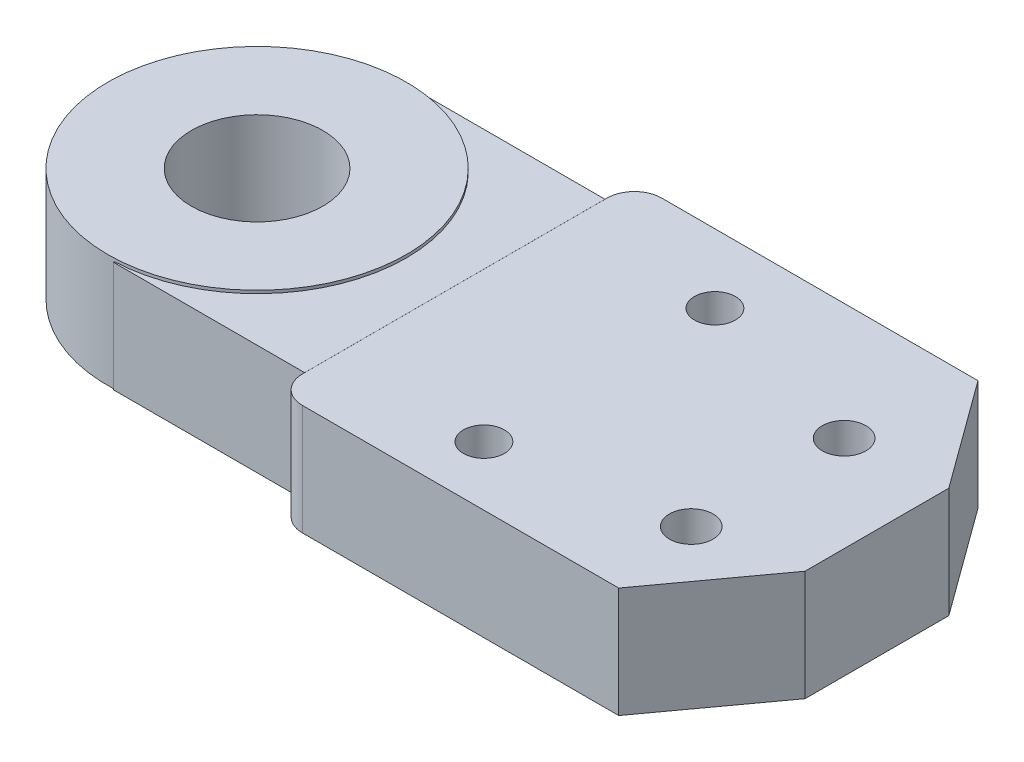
ISO-10303-21;
HEADER;
FILE_DESCRIPTION(('STEP AP214'),'2;1');
FILE_NAME('part.step','',(''),(''),'','','');
FILE_SCHEMA(('AUTOMOTIVE_DESIGN { 1 0 10303 214 1 1 1 1 }'));
ENDSEC;
DATA;
#1=APPLICATION_CONTEXT('core data for automotive mechanical design processes');
#2=APPLICATION_PROTOCOL_DEFINITION('international standard','automotive_design',2000,#1);
#3=PRODUCT_CONTEXT('',#1,'mechanical');
#4=PRODUCT('Part','Part','',(#3));
#5=PRODUCT_RELATED_PRODUCT_CATEGORY('part','',(#4));
#6=PRODUCT_DEFINITION_FORMATION('','',#4);
#7=PRODUCT_DEFINITION_CONTEXT('part definition',#1,'design');
#8=PRODUCT_DEFINITION('design','',#6,#7);
#9=PRODUCT_DEFINITION_SHAPE('','',#8);
#10=(LENGTH_UNIT() NAMED_UNIT(*) SI_UNIT(.MILLI.,.METRE.));
#11=(NAMED_UNIT(*) PLANE_ANGLE_UNIT() SI_UNIT($,.RADIAN.));
#12=(NAMED_UNIT(*) SI_UNIT($,.STERADIAN.) SOLID_ANGLE_UNIT());
#13=UNCERTAINTY_MEASURE_WITH_UNIT(LENGTH_MEASURE(1.E-05),#10,'distance_accuracy_value','');
#14=(GEOMETRIC_REPRESENTATION_CONTEXT(3) GLOBAL_UNCERTAINTY_ASSIGNED_CONTEXT((#13)) GLOBAL_UNIT_ASSIGNED_CONTEXT((#10,
#11,#12)) REPRESENTATION_CONTEXT('',''));
#15=CARTESIAN_POINT('',(0.,0.,0.));
#16=DIRECTION('',(0.,0.,1.));
#17=DIRECTION('',(1.,0.,0.));
#18=AXIS2_PLACEMENT_3D('',#15,#16,#17);
#19=CARTESIAN_POINT('',(-19.3703309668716,4.17290826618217,0.));
#20=DIRECTION('',(0.,-1.,0.));
#21=DIRECTION('',(0.,0.,-1.));
#22=AXIS2_PLACEMENT_3D('',#19,#20,#21);
#23=CYLINDRICAL_SURFACE('',#22,10.9375);
#24=CARTESIAN_POINT('',(-19.3703309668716,4.17290826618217,0.));
#25=DIRECTION('',(0.,1.,0.));
#26=DIRECTION('',(0.,0.,1.));
#27=AXIS2_PLACEMENT_3D('',#24,#25,#26);
#28=CIRCLE('',#27,10.9375);
#29=CARTESIAN_POINT('',(-19.3703309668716,4.17290826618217,10.9375));
#30=VERTEX_POINT('',#29);
#31=EDGE_CURVE('E274',#30,#30,#28,.T.);
#32=ORIENTED_EDGE('',*,*,#31,.F.);
#33=EDGE_LOOP('',(#32));
#34=FACE_BOUND('',#33,.T.);
#35=DIRECTION('',(0.,-1.,0.));
#36=VECTOR('',#35,1.);
#37=CARTESIAN_POINT('',(-18.889961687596,4.17290826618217,10.9269461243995));
#38=LINE('',#37,#36);
#39=CARTESIAN_POINT('',(-18.889961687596,-4.13959173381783,10.9269461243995));
#40=VERTEX_POINT('',#39);
#41=CARTESIAN_POINT('',(-18.889961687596,3.95415826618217,10.9269461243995));
#42=VERTEX_POINT('',#41);
#43=EDGE_CURVE('E253',#40,#42,#38,.F.);
#44=ORIENTED_EDGE('',*,*,#43,.T.);
#45=CARTESIAN_POINT('',(-19.3703309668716,3.95415826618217,0.));
#46=DIRECTION('',(0.,-1.,0.));
#47=DIRECTION('',(0.,0.,-1.));
#48=AXIS2_PLACEMENT_3D('',#45,#46,#47);
#49=CIRCLE('',#48,10.9375);
#50=CARTESIAN_POINT('',(-18.889961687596,3.95415826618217,-10.9269461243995));
#51=VERTEX_POINT('',#50);
#52=EDGE_CURVE('E53',#42,#51,#49,.F.);
#53=ORIENTED_EDGE('',*,*,#52,.T.);
#54=DIRECTION('',(0.,-1.,0.));
#55=VECTOR('',#54,1.);
#56=CARTESIAN_POINT('',(-18.889961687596,4.17290826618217,-10.9269461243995));
#57=LINE('',#56,#55);
#58=CARTESIAN_POINT('',(-18.889961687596,-4.13959173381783,-10.9269461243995));
#59=VERTEX_POINT('',#58);
#60=EDGE_CURVE('E244',#59,#51,#57,.F.);
#61=ORIENTED_EDGE('',*,*,#60,.F.);
#62=CARTESIAN_POINT('',(-19.3703309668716,-4.13959173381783,0.));
#63=DIRECTION('',(0.,1.,0.));
#64=DIRECTION('',(0.,0.,1.));
#65=AXIS2_PLACEMENT_3D('',#62,#63,#64);
#66=CIRCLE('',#65,10.9375);
#67=EDGE_CURVE('E277',#59,#40,#66,.T.);
#68=ORIENTED_EDGE('',*,*,#67,.T.);
#69=EDGE_LOOP('',(#44,#53,#61,#68));
#70=FACE_BOUND('',#69,.T.);
#71=ADVANCED_FACE('F46',(#34,#70),#23,.T.);
#72=CARTESIAN_POINT('',(-19.3703309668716,4.17290826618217,0.));
#73=DIRECTION('',(0.,1.,0.));
#74=DIRECTION('',(0.,0.,1.));
#75=AXIS2_PLACEMENT_3D('',#72,#73,#74);
#76=PLANE('',#75);
#77=CARTESIAN_POINT('',(-19.3703309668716,4.17290826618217,0.));
#78=DIRECTION('',(0.,1.,0.));
#79=DIRECTION('',(0.,0.,1.));
#80=AXIS2_PLACEMENT_3D('',#77,#78,#79);
#81=CIRCLE('',#80,4.8125);
#82=CARTESIAN_POINT('',(-19.3703309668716,4.17290826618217,4.8125));
#83=VERTEX_POINT('',#82);
#84=EDGE_CURVE('E270',#83,#83,#81,.T.);
#85=ORIENTED_EDGE('',*,*,#84,.F.);
#86=EDGE_LOOP('',(#85));
#87=FACE_BOUND('',#86,.T.);
#88=ORIENTED_EDGE('',*,*,#31,.T.);
#89=EDGE_LOOP('',(#88));
#90=FACE_BOUND('',#89,.T.);
#91=ADVANCED_FACE('F300',(#87,#90),#76,.T.);
#92=CARTESIAN_POINT('',(-19.3703309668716,-4.13959173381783,0.));
#93=DIRECTION('',(0.,1.,0.));
#94=DIRECTION('',(0.,0.,1.));
#95=AXIS2_PLACEMENT_3D('',#92,#93,#94);
#96=PLANE('',#95);
#97=ORIENTED_EDGE('',*,*,#67,.F.);
#98=DIRECTION('',(0.,0.,1.));
#99=VECTOR('',#98,1.);
#100=CARTESIAN_POINT('',(-18.889961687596,-4.13959173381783,-5.55625));
#101=LINE('',#100,#99);
#102=CARTESIAN_POINT('',(-18.889961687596,-4.13959173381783,-11.));
#103=VERTEX_POINT('',#102);
#104=EDGE_CURVE('E222',#103,#59,#101,.T.);
#105=ORIENTED_EDGE('',*,*,#104,.F.);
#106=DIRECTION('',(-1.,0.,0.));
#107=VECTOR('',#106,1.);
#108=CARTESIAN_POINT('',(-4.88996168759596,-4.13959173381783,-11.));
#109=LINE('',#108,#107);
#110=CARTESIAN_POINT('',(-4.88996168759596,-4.13959173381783,-11.));
#111=VERTEX_POINT('',#110);
#112=EDGE_CURVE('E266',#111,#103,#109,.T.);
#113=ORIENTED_EDGE('',*,*,#112,.F.);
#114=DIRECTION('',(0.,0.,-1.));
#115=VECTOR('',#114,1.);
#116=CARTESIAN_POINT('',(-4.88996168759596,-4.13959173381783,11.));
#117=LINE('',#116,#115);
#118=CARTESIAN_POINT('',(-4.88996168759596,-4.13959173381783,-11.1568220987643));
#119=VERTEX_POINT('',#118);
#120=EDGE_CURVE('E217',#111,#119,#117,.T.);
#121=ORIENTED_EDGE('',*,*,#120,.T.);
#122=CARTESIAN_POINT('',(-2.88996168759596,-4.13959173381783,-11.1568220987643));
#123=DIRECTION('',(0.,-1.,0.));
#124=DIRECTION('',(0.,0.,1.));
#125=AXIS2_PLACEMENT_3D('',#122,#123,#124);
#126=CIRCLE('',#125,2.);
#127=CARTESIAN_POINT('',(-2.88996168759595,-4.13959173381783,-13.1568220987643));
#128=VERTEX_POINT('',#127);
#129=EDGE_CURVE('E169',#119,#128,#126,.T.);
#130=ORIENTED_EDGE('',*,*,#129,.T.);
#131=DIRECTION('',(1.,0.,0.));
#132=VECTOR('',#131,1.);
#133=CARTESIAN_POINT('',(-2.88996168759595,-4.13959173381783,-13.1568220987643));
#134=LINE('',#133,#132);
#135=CARTESIAN_POINT('',(20.2789521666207,-4.13959173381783,-13.1568220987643));
#136=VERTEX_POINT('',#135);
#137=EDGE_CURVE('E198',#128,#136,#134,.T.);
#138=ORIENTED_EDGE('',*,*,#137,.T.);
#139=DIRECTION('',(0.58903658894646,0.,0.808106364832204));
#140=VECTOR('',#139,1.);
#141=CARTESIAN_POINT('',(20.2789521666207,-4.13959173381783,-13.1568220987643));
#142=LINE('',#141,#140);
#143=CARTESIAN_POINT('',(26.0303023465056,-4.13959173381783,-5.26647577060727));
#144=VERTEX_POINT('',#143);
#145=EDGE_CURVE('E202',#136,#144,#142,.T.);
#146=ORIENTED_EDGE('',*,*,#145,.T.);
#147=DIRECTION('',(0.,0.,1.));
#148=VECTOR('',#147,1.);
#149=CARTESIAN_POINT('',(26.0303023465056,-4.13959173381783,5.26647577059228));
#150=LINE('',#149,#148);
#151=CARTESIAN_POINT('',(26.0303023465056,-4.13959173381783,5.26647577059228));
#152=VERTEX_POINT('',#151);
#153=EDGE_CURVE('E205',#144,#152,#150,.T.);
#154=ORIENTED_EDGE('',*,*,#153,.T.);
#155=DIRECTION('',(-0.589180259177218,0.,0.808001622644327));
#156=VECTOR('',#155,1.);
#157=CARTESIAN_POINT('',(26.0303023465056,-4.13959173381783,5.26647577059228));
#158=LINE('',#157,#156);
#159=CARTESIAN_POINT('',(20.2768036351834,-4.13959173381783,13.1568220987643));
#160=VERTEX_POINT('',#159);
#161=EDGE_CURVE('E208',#152,#160,#158,.T.);
#162=ORIENTED_EDGE('',*,*,#161,.T.);
#163=DIRECTION('',(-1.,0.,0.));
#164=VECTOR('',#163,1.);
#165=CARTESIAN_POINT('',(-2.88996168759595,-4.13959173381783,13.1568220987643));
#166=LINE('',#165,#164);
#167=CARTESIAN_POINT('',(-2.88996168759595,-4.13959173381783,13.1568220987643));
#168=VERTEX_POINT('',#167);
#169=EDGE_CURVE('E211',#160,#168,#166,.T.);
#170=ORIENTED_EDGE('',*,*,#169,.T.);
#171=CARTESIAN_POINT('',(-2.88996168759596,-4.13959173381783,11.1568220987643));
#172=DIRECTION('',(0.,-1.,0.));
#173=DIRECTION('',(0.,0.,-1.));
#174=AXIS2_PLACEMENT_3D('',#171,#172,#173);
#175=CIRCLE('',#174,2.);
#176=CARTESIAN_POINT('',(-4.88996168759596,-4.13959173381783,11.1568220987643));
#177=VERTEX_POINT('',#176);
#178=EDGE_CURVE('E214',#168,#177,#175,.T.);
#179=ORIENTED_EDGE('',*,*,#178,.T.);
#180=CARTESIAN_POINT('',(-4.88996168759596,-4.13959173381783,11.));
#181=VERTEX_POINT('',#180);
#182=EDGE_CURVE('E162',#177,#181,#117,.T.);
#183=ORIENTED_EDGE('',*,*,#182,.T.);
#184=DIRECTION('',(-1.,0.,0.));
#185=VECTOR('',#184,1.);
#186=CARTESIAN_POINT('',(-4.88996168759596,-4.13959173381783,11.));
#187=LINE('',#186,#185);
#188=CARTESIAN_POINT('',(-18.889961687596,-4.13959173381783,11.));
#189=VERTEX_POINT('',#188);
#190=EDGE_CURVE('E268',#181,#189,#187,.T.);
#191=ORIENTED_EDGE('',*,*,#190,.T.);
#192=DIRECTION('',(0.,0.,1.));
#193=VECTOR('',#192,1.);
#194=CARTESIAN_POINT('',(-18.889961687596,-4.13959173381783,5.55625));
#195=LINE('',#194,#193);
#196=EDGE_CURVE('E234',#40,#189,#195,.T.);
#197=ORIENTED_EDGE('',*,*,#196,.F.);
#198=EDGE_LOOP('',(#97,#105,#113,#121,#130,#138,#146,#154,#162,#170,#179,#183,#191,#197));
#199=FACE_BOUND('',#198,.T.);
#200=CARTESIAN_POINT('',(-19.3703309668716,-4.13959173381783,0.));
#201=DIRECTION('',(0.,1.,0.));
#202=DIRECTION('',(0.,0.,1.));
#203=AXIS2_PLACEMENT_3D('',#200,#201,#202);
#204=CIRCLE('',#203,4.8125);
#205=CARTESIAN_POINT('',(-19.3703309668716,-4.13959173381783,4.8125));
#206=VERTEX_POINT('',#205);
#207=EDGE_CURVE('E273',#206,#206,#204,.T.);
#208=ORIENTED_EDGE('',*,*,#207,.T.);
#209=EDGE_LOOP('',(#208));
#210=FACE_BOUND('',#209,.T.);
#211=CARTESIAN_POINT('',(19.0301497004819,-4.13959173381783,6.59999999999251));
#212=DIRECTION('',(0.,-1.,0.));
#213=DIRECTION('',(0.,0.,-1.));
#214=AXIS2_PLACEMENT_3D('',#211,#212,#213);
#215=CIRCLE('',#214,1.6);
#216=CARTESIAN_POINT('',(19.0301497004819,-4.13959173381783,4.9999999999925));
#217=VERTEX_POINT('',#216);
#218=EDGE_CURVE('E540',#217,#217,#215,.T.);
#219=ORIENTED_EDGE('',*,*,#218,.F.);
#220=EDGE_LOOP('',(#219));
#221=FACE_BOUND('',#220,.T.);
#222=CARTESIAN_POINT('',(19.0301497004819,-4.13959173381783,-4.60000000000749));
#223=DIRECTION('',(0.,-1.,0.));
#224=DIRECTION('',(0.,0.,-1.));
#225=AXIS2_PLACEMENT_3D('',#222,#223,#224);
#226=CIRCLE('',#225,1.6);
#227=CARTESIAN_POINT('',(19.0301497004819,-4.13959173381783,-6.2000000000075));
#228=VERTEX_POINT('',#227);
#229=EDGE_CURVE('E542',#228,#228,#226,.T.);
#230=ORIENTED_EDGE('',*,*,#229,.F.);
#231=EDGE_LOOP('',(#230));
#232=FACE_BOUND('',#231,.T.);
#233=CARTESIAN_POINT('',(6.05248255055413,-4.13959173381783,8.80880722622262));
#234=DIRECTION('',(0.,-1.,0.));
#235=DIRECTION('',(0.,0.,-1.));
#236=AXIS2_PLACEMENT_3D('',#233,#234,#235);
#237=CIRCLE('',#236,1.49999999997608);
#238=CARTESIAN_POINT('',(6.05248255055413,-4.13959173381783,7.30880722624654));
#239=VERTEX_POINT('',#238);
#240=EDGE_CURVE('E548',#239,#239,#237,.T.);
#241=ORIENTED_EDGE('',*,*,#240,.F.);
#242=EDGE_LOOP('',(#241));
#243=FACE_BOUND('',#242,.T.);
#244=CARTESIAN_POINT('',(6.05248255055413,-4.13959173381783,-8.11236893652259));
#245=DIRECTION('',(0.,-1.,0.));
#246=DIRECTION('',(0.,0.,-1.));
#247=AXIS2_PLACEMENT_3D('',#244,#245,#246);
#248=CIRCLE('',#247,1.49999999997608);
#249=CARTESIAN_POINT('',(6.05248255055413,-4.13959173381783,-9.61236893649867));
#250=VERTEX_POINT('',#249);
#251=EDGE_CURVE('E554',#250,#250,#248,.T.);
#252=ORIENTED_EDGE('',*,*,#251,.F.);
#253=EDGE_LOOP('',(#252));
#254=FACE_BOUND('',#253,.T.);
#255=ADVANCED_FACE('F283',(#199,#210,#221,#232,#243,#254),#96,.F.);
#256=CARTESIAN_POINT('',(-19.3703309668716,-10.2645917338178,0.));
#257=DIRECTION('',(0.,1.,0.));
#258=DIRECTION('',(0.,0.,1.));
#259=AXIS2_PLACEMENT_3D('',#256,#257,#258);
#260=CYLINDRICAL_SURFACE('',#259,4.8125);
#261=ORIENTED_EDGE('',*,*,#84,.T.);
#262=EDGE_LOOP('',(#261));
#263=FACE_BOUND('',#262,.T.);
#264=ORIENTED_EDGE('',*,*,#207,.F.);
#265=EDGE_LOOP('',(#264));
#266=FACE_BOUND('',#265,.T.);
#267=ADVANCED_FACE('F286',(#263,#266),#260,.F.);
#268=CARTESIAN_POINT('',(-8.88996168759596,3.95415826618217,5.55625));
#269=DIRECTION('',(0.,-1.,0.));
#270=DIRECTION('',(0.,0.,-1.));
#271=AXIS2_PLACEMENT_3D('',#268,#269,#270);
#272=PLANE('',#271);
#273=ORIENTED_EDGE('',*,*,#52,.F.);
#274=DIRECTION('',(0.,0.,-1.));
#275=VECTOR('',#274,1.);
#276=CARTESIAN_POINT('',(-18.889961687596,3.95415826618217,5.55625));
#277=LINE('',#276,#275);
#278=CARTESIAN_POINT('',(-18.889961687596,3.95415826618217,11.));
#279=VERTEX_POINT('',#278);
#280=EDGE_CURVE('E241',#279,#42,#277,.T.);
#281=ORIENTED_EDGE('',*,*,#280,.F.);
#282=DIRECTION('',(-1.,0.,0.));
#283=VECTOR('',#282,1.);
#284=CARTESIAN_POINT('',(-4.88996168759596,3.95415826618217,11.));
#285=LINE('',#284,#283);
#286=CARTESIAN_POINT('',(-4.88996168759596,3.95415826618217,11.));
#287=VERTEX_POINT('',#286);
#288=EDGE_CURVE('E262',#287,#279,#285,.T.);
#289=ORIENTED_EDGE('',*,*,#288,.F.);
#290=DIRECTION('',(0.,0.,1.));
#291=VECTOR('',#290,1.);
#292=CARTESIAN_POINT('',(-4.88996168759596,3.95415826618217,11.));
#293=LINE('',#292,#291);
#294=CARTESIAN_POINT('',(-4.88996168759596,3.95415826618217,-11.));
#295=VERTEX_POINT('',#294);
#296=EDGE_CURVE('E260',#295,#287,#293,.T.);
#297=ORIENTED_EDGE('',*,*,#296,.F.);
#298=DIRECTION('',(-1.,0.,0.));
#299=VECTOR('',#298,1.);
#300=CARTESIAN_POINT('',(-4.88996168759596,3.95415826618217,-11.));
#301=LINE('',#300,#299);
#302=CARTESIAN_POINT('',(-18.889961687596,3.95415826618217,-11.));
#303=VERTEX_POINT('',#302);
#304=EDGE_CURVE('E264',#295,#303,#301,.T.);
#305=ORIENTED_EDGE('',*,*,#304,.T.);
#306=DIRECTION('',(0.,0.,-1.));
#307=VECTOR('',#306,1.);
#308=CARTESIAN_POINT('',(-18.889961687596,3.95415826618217,-5.55625));
#309=LINE('',#308,#307);
#310=EDGE_CURVE('E238',#51,#303,#309,.T.);
#311=ORIENTED_EDGE('',*,*,#310,.F.);
#312=EDGE_LOOP('',(#273,#281,#289,#297,#305,#311));
#313=FACE_BOUND('',#312,.T.);
#314=ADVANCED_FACE('F288',(#313),#272,.F.);
#315=CARTESIAN_POINT('',(-4.88996168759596,3.95415826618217,11.));
#316=DIRECTION('',(0.,0.,-1.));
#317=DIRECTION('',(0.,1.,0.));
#318=AXIS2_PLACEMENT_3D('',#315,#316,#317);
#319=PLANE('',#318);
#320=ORIENTED_EDGE('',*,*,#288,.T.);
#321=DIRECTION('',(0.,1.,0.));
#322=VECTOR('',#321,1.);
#323=CARTESIAN_POINT('',(-18.889961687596,3.95415826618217,11.));
#324=LINE('',#323,#322);
#325=EDGE_CURVE('E237',#189,#279,#324,.T.);
#326=ORIENTED_EDGE('',*,*,#325,.F.);
#327=ORIENTED_EDGE('',*,*,#190,.F.);
#328=DIRECTION('',(0.,-1.,0.));
#329=VECTOR('',#328,1.);
#330=CARTESIAN_POINT('',(-4.88996168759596,3.95415826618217,11.));
#331=LINE('',#330,#329);
#332=CARTESIAN_POINT('',(-4.88996168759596,3.95040826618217,11.));
#333=VERTEX_POINT('',#332);
#334=EDGE_CURVE('E66',#333,#181,#331,.T.);
#335=ORIENTED_EDGE('',*,*,#334,.F.);
#336=EDGE_CURVE('E256',#287,#333,#331,.T.);
#337=ORIENTED_EDGE('',*,*,#336,.F.);
#338=EDGE_LOOP('',(#320,#326,#327,#335,#337));
#339=FACE_BOUND('',#338,.T.);
#340=ADVANCED_FACE('F296',(#339),#319,.F.);
#341=CARTESIAN_POINT('',(-4.88996168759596,3.95415826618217,-11.));
#342=DIRECTION('',(0.,0.,1.));
#343=DIRECTION('',(1.,0.,0.));
#344=AXIS2_PLACEMENT_3D('',#341,#342,#343);
#345=PLANE('',#344);
#346=ORIENTED_EDGE('',*,*,#112,.T.);
#347=DIRECTION('',(0.,-1.,0.));
#348=VECTOR('',#347,1.);
#349=CARTESIAN_POINT('',(-18.889961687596,3.95415826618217,-11.));
#350=LINE('',#349,#348);
#351=EDGE_CURVE('E246',#303,#103,#350,.T.);
#352=ORIENTED_EDGE('',*,*,#351,.F.);
#353=ORIENTED_EDGE('',*,*,#304,.F.);
#354=DIRECTION('',(0.,1.,0.));
#355=VECTOR('',#354,1.);
#356=CARTESIAN_POINT('',(-4.88996168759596,3.95415826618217,-11.));
#357=LINE('',#356,#355);
#358=CARTESIAN_POINT('',(-4.88996168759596,3.95040826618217,-11.));
#359=VERTEX_POINT('',#358);
#360=EDGE_CURVE('E258',#359,#295,#357,.T.);
#361=ORIENTED_EDGE('',*,*,#360,.F.);
#362=EDGE_CURVE('E158',#111,#359,#357,.T.);
#363=ORIENTED_EDGE('',*,*,#362,.F.);
#364=EDGE_LOOP('',(#346,#352,#353,#361,#363));
#365=FACE_BOUND('',#364,.T.);
#366=ADVANCED_FACE('F345',(#365),#345,.F.);
#367=CARTESIAN_POINT('',(-4.88996168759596,0.,0.));
#368=DIRECTION('',(1.,0.,0.));
#369=DIRECTION('',(0.,0.,-1.));
#370=AXIS2_PLACEMENT_3D('',#367,#368,#369);
#371=PLANE('',#370);
#372=DIRECTION('',(0.,0.,1.));
#373=VECTOR('',#372,1.);
#374=CARTESIAN_POINT('',(-4.88996168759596,3.95040826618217,0.));
#375=LINE('',#374,#373);
#376=EDGE_CURVE('E12',#359,#333,#375,.T.);
#377=ORIENTED_EDGE('',*,*,#376,.F.);
#378=ORIENTED_EDGE('',*,*,#360,.T.);
#379=ORIENTED_EDGE('',*,*,#296,.T.);
#380=ORIENTED_EDGE('',*,*,#336,.T.);
#381=EDGE_LOOP('',(#377,#378,#379,#380));
#382=FACE_BOUND('',#381,.T.);
#383=ADVANCED_FACE('F352',(#382),#371,.T.);
#384=CARTESIAN_POINT('',(-18.889961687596,0.,0.));
#385=DIRECTION('',(1.,0.,0.));
#386=DIRECTION('',(0.,0.,-1.));
#387=AXIS2_PLACEMENT_3D('',#384,#385,#386);
#388=PLANE('',#387);
#389=ORIENTED_EDGE('',*,*,#104,.T.);
#390=ORIENTED_EDGE('',*,*,#60,.T.);
#391=ORIENTED_EDGE('',*,*,#310,.T.);
#392=ORIENTED_EDGE('',*,*,#351,.T.);
#393=EDGE_LOOP('',(#389,#390,#391,#392));
#394=FACE_BOUND('',#393,.T.);
#395=ADVANCED_FACE('F348',(#394),#388,.F.);
#396=CARTESIAN_POINT('',(-18.889961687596,0.,0.));
#397=DIRECTION('',(-1.,0.,0.));
#398=DIRECTION('',(0.,0.,1.));
#399=AXIS2_PLACEMENT_3D('',#396,#397,#398);
#400=PLANE('',#399);
#401=ORIENTED_EDGE('',*,*,#43,.F.);
#402=ORIENTED_EDGE('',*,*,#196,.T.);
#403=ORIENTED_EDGE('',*,*,#325,.T.);
#404=ORIENTED_EDGE('',*,*,#280,.T.);
#405=EDGE_LOOP('',(#401,#402,#403,#404));
#406=FACE_BOUND('',#405,.T.);
#407=ADVANCED_FACE('F313',(#406),#400,.T.);
#408=CARTESIAN_POINT('',(-4.88996168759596,3.95040826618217,11.));
#409=DIRECTION('',(-1.,0.,0.));
#410=DIRECTION('',(0.,0.,1.));
#411=AXIS2_PLACEMENT_3D('',#408,#409,#410);
#412=PLANE('',#411);
#413=ORIENTED_EDGE('',*,*,#334,.T.);
#414=ORIENTED_EDGE('',*,*,#182,.F.);
#415=DIRECTION('',(0.,-1.,0.));
#416=VECTOR('',#415,1.);
#417=CARTESIAN_POINT('',(-4.88996168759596,3.95040826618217,11.1568220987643));
#418=LINE('',#417,#416);
#419=CARTESIAN_POINT('',(-4.88996168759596,3.95040826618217,11.1568220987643));
#420=VERTEX_POINT('',#419);
#421=EDGE_CURVE('E220',#420,#177,#418,.T.);
#422=ORIENTED_EDGE('',*,*,#421,.F.);
#423=DIRECTION('',(0.,0.,-1.));
#424=VECTOR('',#423,1.);
#425=CARTESIAN_POINT('',(-4.88996168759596,3.95040826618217,11.));
#426=LINE('',#425,#424);
#427=EDGE_CURVE('E161',#420,#333,#426,.T.);
#428=ORIENTED_EDGE('',*,*,#427,.T.);
#429=EDGE_LOOP('',(#413,#414,#422,#428));
#430=FACE_BOUND('',#429,.T.);
#431=ADVANCED_FACE('F319',(#430),#412,.T.);
#432=ORIENTED_EDGE('',*,*,#362,.T.);
#433=CARTESIAN_POINT('',(-4.88996168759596,3.95040826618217,-11.1568220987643));
#434=VERTEX_POINT('',#433);
#435=EDGE_CURVE('E152',#359,#434,#426,.T.);
#436=ORIENTED_EDGE('',*,*,#435,.T.);
#437=DIRECTION('',(0.,-1.,0.));
#438=VECTOR('',#437,1.);
#439=CARTESIAN_POINT('',(-4.88996168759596,3.95040826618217,-11.1568220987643));
#440=LINE('',#439,#438);
#441=EDGE_CURVE('E156',#434,#119,#440,.T.);
#442=ORIENTED_EDGE('',*,*,#441,.T.);
#443=ORIENTED_EDGE('',*,*,#120,.F.);
#444=EDGE_LOOP('',(#432,#436,#442,#443));
#445=FACE_BOUND('',#444,.T.);
#446=ADVANCED_FACE('F154',(#445),#412,.T.);
#447=CARTESIAN_POINT('',(-2.88996168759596,3.95040826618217,11.1568220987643));
#448=DIRECTION('',(0.,-1.,0.));
#449=DIRECTION('',(0.,0.,-1.));
#450=AXIS2_PLACEMENT_3D('',#447,#448,#449);
#451=CYLINDRICAL_SURFACE('',#450,2.);
#452=ORIENTED_EDGE('',*,*,#178,.F.);
#453=DIRECTION('',(0.,-1.,0.));
#454=VECTOR('',#453,1.);
#455=CARTESIAN_POINT('',(-2.88996168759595,3.95040826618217,13.1568220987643));
#456=LINE('',#455,#454);
#457=CARTESIAN_POINT('',(-2.88996168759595,3.95040826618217,13.1568220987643));
#458=VERTEX_POINT('',#457);
#459=EDGE_CURVE('E223',#458,#168,#456,.T.);
#460=ORIENTED_EDGE('',*,*,#459,.F.);
#461=CARTESIAN_POINT('',(-2.88996168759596,3.95040826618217,11.1568220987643));
#462=DIRECTION('',(0.,-1.,0.));
#463=DIRECTION('',(0.,0.,-1.));
#464=AXIS2_PLACEMENT_3D('',#461,#462,#463);
#465=CIRCLE('',#464,2.);
#466=EDGE_CURVE('E171',#458,#420,#465,.T.);
#467=ORIENTED_EDGE('',*,*,#466,.T.);
#468=ORIENTED_EDGE('',*,*,#421,.T.);
#469=EDGE_LOOP('',(#452,#460,#467,#468));
#470=FACE_BOUND('',#469,.T.);
#471=ADVANCED_FACE('F421',(#470),#451,.T.);
#472=CARTESIAN_POINT('',(-2.88996168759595,3.95040826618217,13.1568220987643));
#473=DIRECTION('',(0.,0.,1.));
#474=DIRECTION('',(1.,0.,0.));
#475=AXIS2_PLACEMENT_3D('',#472,#473,#474);
#476=PLANE('',#475);
#477=ORIENTED_EDGE('',*,*,#169,.F.);
#478=DIRECTION('',(0.,-1.,0.));
#479=VECTOR('',#478,1.);
#480=CARTESIAN_POINT('',(20.2768036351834,3.95040826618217,13.1568220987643));
#481=LINE('',#480,#479);
#482=CARTESIAN_POINT('',(20.2768036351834,3.95040826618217,13.1568220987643));
#483=VERTEX_POINT('',#482);
#484=EDGE_CURVE('E225',#483,#160,#481,.T.);
#485=ORIENTED_EDGE('',*,*,#484,.F.);
#486=DIRECTION('',(-1.,0.,0.));
#487=VECTOR('',#486,1.);
#488=CARTESIAN_POINT('',(-2.88996168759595,3.95040826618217,13.1568220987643));
#489=LINE('',#488,#487);
#490=EDGE_CURVE('E192',#483,#458,#489,.T.);
#491=ORIENTED_EDGE('',*,*,#490,.T.);
#492=ORIENTED_EDGE('',*,*,#459,.T.);
#493=EDGE_LOOP('',(#477,#485,#491,#492));
#494=FACE_BOUND('',#493,.T.);
#495=ADVANCED_FACE('F327',(#494),#476,.T.);
#496=CARTESIAN_POINT('',(26.0303023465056,3.95040826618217,5.26647577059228));
#497=DIRECTION('',(0.808001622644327,0.,0.589180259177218));
#498=DIRECTION('',(0.589180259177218,0.,-0.808001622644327));
#499=AXIS2_PLACEMENT_3D('',#496,#497,#498);
#500=PLANE('',#499);
#501=ORIENTED_EDGE('',*,*,#161,.F.);
#502=DIRECTION('',(0.,-1.,0.));
#503=VECTOR('',#502,1.);
#504=CARTESIAN_POINT('',(26.0303023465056,3.95040826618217,5.26647577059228));
#505=LINE('',#504,#503);
#506=CARTESIAN_POINT('',(26.0303023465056,3.95040826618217,5.26647577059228));
#507=VERTEX_POINT('',#506);
#508=EDGE_CURVE('E227',#507,#152,#505,.T.);
#509=ORIENTED_EDGE('',*,*,#508,.F.);
#510=DIRECTION('',(-0.589180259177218,0.,0.808001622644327));
#511=VECTOR('',#510,1.);
#512=CARTESIAN_POINT('',(26.0303023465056,3.95040826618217,5.26647577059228));
#513=LINE('',#512,#511);
#514=EDGE_CURVE('E189',#507,#483,#513,.T.);
#515=ORIENTED_EDGE('',*,*,#514,.T.);
#516=ORIENTED_EDGE('',*,*,#484,.T.);
#517=EDGE_LOOP('',(#501,#509,#515,#516));
#518=FACE_BOUND('',#517,.T.);
#519=ADVANCED_FACE('F331',(#518),#500,.T.);
#520=CARTESIAN_POINT('',(26.0303023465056,3.95040826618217,5.26647577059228));
#521=DIRECTION('',(1.,0.,0.));
#522=DIRECTION('',(0.,0.,-1.));
#523=AXIS2_PLACEMENT_3D('',#520,#521,#522);
#524=PLANE('',#523);
#525=ORIENTED_EDGE('',*,*,#153,.F.);
#526=DIRECTION('',(0.,-1.,0.));
#527=VECTOR('',#526,1.);
#528=CARTESIAN_POINT('',(26.0303023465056,3.95040826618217,-5.26647577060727));
#529=LINE('',#528,#527);
#530=CARTESIAN_POINT('',(26.0303023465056,3.95040826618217,-5.26647577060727));
#531=VERTEX_POINT('',#530);
#532=EDGE_CURVE('E229',#531,#144,#529,.T.);
#533=ORIENTED_EDGE('',*,*,#532,.F.);
#534=DIRECTION('',(0.,0.,1.));
#535=VECTOR('',#534,1.);
#536=CARTESIAN_POINT('',(26.0303023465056,3.95040826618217,5.26647577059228));
#537=LINE('',#536,#535);
#538=EDGE_CURVE('E186',#531,#507,#537,.T.);
#539=ORIENTED_EDGE('',*,*,#538,.T.);
#540=ORIENTED_EDGE('',*,*,#508,.T.);
#541=EDGE_LOOP('',(#525,#533,#539,#540));
#542=FACE_BOUND('',#541,.T.);
#543=ADVANCED_FACE('F335',(#542),#524,.T.);
#544=CARTESIAN_POINT('',(20.2789521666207,3.95040826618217,-13.1568220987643));
#545=DIRECTION('',(0.808106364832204,0.,-0.58903658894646));
#546=DIRECTION('',(-0.58903658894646,0.,-0.808106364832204));
#547=AXIS2_PLACEMENT_3D('',#544,#545,#546);
#548=PLANE('',#547);
#549=ORIENTED_EDGE('',*,*,#145,.F.);
#550=DIRECTION('',(0.,-1.,0.));
#551=VECTOR('',#550,1.);
#552=CARTESIAN_POINT('',(20.2789521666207,3.95040826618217,-13.1568220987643));
#553=LINE('',#552,#551);
#554=CARTESIAN_POINT('',(20.2789521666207,3.95040826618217,-13.1568220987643));
#555=VERTEX_POINT('',#554);
#556=EDGE_CURVE('E231',#555,#136,#553,.T.);
#557=ORIENTED_EDGE('',*,*,#556,.F.);
#558=DIRECTION('',(0.58903658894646,0.,0.808106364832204));
#559=VECTOR('',#558,1.);
#560=CARTESIAN_POINT('',(20.2789521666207,3.95040826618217,-13.1568220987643));
#561=LINE('',#560,#559);
#562=EDGE_CURVE('E179',#555,#531,#561,.T.);
#563=ORIENTED_EDGE('',*,*,#562,.T.);
#564=ORIENTED_EDGE('',*,*,#532,.T.);
#565=EDGE_LOOP('',(#549,#557,#563,#564));
#566=FACE_BOUND('',#565,.T.);
#567=ADVANCED_FACE('F338',(#566),#548,.T.);
#568=CARTESIAN_POINT('',(-2.88996168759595,3.95040826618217,-13.1568220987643));
#569=DIRECTION('',(0.,0.,-1.));
#570=DIRECTION('',(-1.,0.,0.));
#571=AXIS2_PLACEMENT_3D('',#568,#569,#570);
#572=PLANE('',#571);
#573=ORIENTED_EDGE('',*,*,#137,.F.);
#574=DIRECTION('',(0.,-1.,0.));
#575=VECTOR('',#574,1.);
#576=CARTESIAN_POINT('',(-2.88996168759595,3.95040826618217,-13.1568220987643));
#577=LINE('',#576,#575);
#578=CARTESIAN_POINT('',(-2.88996168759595,3.95040826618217,-13.1568220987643));
#579=VERTEX_POINT('',#578);
#580=EDGE_CURVE('E170',#579,#128,#577,.T.);
#581=ORIENTED_EDGE('',*,*,#580,.F.);
#582=DIRECTION('',(1.,0.,0.));
#583=VECTOR('',#582,1.);
#584=CARTESIAN_POINT('',(-2.88996168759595,3.95040826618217,-13.1568220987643));
#585=LINE('',#584,#583);
#586=EDGE_CURVE('E177',#579,#555,#585,.T.);
#587=ORIENTED_EDGE('',*,*,#586,.T.);
#588=ORIENTED_EDGE('',*,*,#556,.T.);
#589=EDGE_LOOP('',(#573,#581,#587,#588));
#590=FACE_BOUND('',#589,.T.);
#591=ADVANCED_FACE('F341',(#590),#572,.T.);
#592=CARTESIAN_POINT('',(-2.88996168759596,3.95040826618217,-11.1568220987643));
#593=DIRECTION('',(0.,-1.,0.));
#594=DIRECTION('',(0.,0.,-1.));
#595=AXIS2_PLACEMENT_3D('',#592,#593,#594);
#596=CYLINDRICAL_SURFACE('',#595,2.);
#597=ORIENTED_EDGE('',*,*,#129,.F.);
#598=ORIENTED_EDGE('',*,*,#441,.F.);
#599=CARTESIAN_POINT('',(-2.88996168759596,3.95040826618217,-11.1568220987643));
#600=DIRECTION('',(0.,-1.,0.));
#601=DIRECTION('',(0.,0.,1.));
#602=AXIS2_PLACEMENT_3D('',#599,#600,#601);
#603=CIRCLE('',#602,2.);
#604=EDGE_CURVE('E167',#434,#579,#603,.T.);
#605=ORIENTED_EDGE('',*,*,#604,.T.);
#606=ORIENTED_EDGE('',*,*,#580,.T.);
#607=EDGE_LOOP('',(#597,#598,#605,#606));
#608=FACE_BOUND('',#607,.T.);
#609=ADVANCED_FACE('F166',(#608),#596,.T.);
#610=CARTESIAN_POINT('',(-2.88996168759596,3.95040826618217,-11.1568220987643));
#611=DIRECTION('',(0.,1.,0.));
#612=DIRECTION('',(0.,0.,1.));
#613=AXIS2_PLACEMENT_3D('',#610,#611,#612);
#614=PLANE('',#613);
#615=CARTESIAN_POINT('',(19.0301497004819,3.95040826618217,6.59999999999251));
#616=DIRECTION('',(0.,-1.,0.));
#617=DIRECTION('',(0.,0.,-1.));
#618=AXIS2_PLACEMENT_3D('',#615,#616,#617);
#619=CIRCLE('',#618,1.6);
#620=CARTESIAN_POINT('',(19.0301497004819,3.95040826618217,4.9999999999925));
#621=VERTEX_POINT('',#620);
#622=EDGE_CURVE('E537',#621,#621,#619,.T.);
#623=ORIENTED_EDGE('',*,*,#622,.T.);
#624=EDGE_LOOP('',(#623));
#625=FACE_BOUND('',#624,.T.);
#626=CARTESIAN_POINT('',(19.0301497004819,3.95040826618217,-4.60000000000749));
#627=DIRECTION('',(0.,-1.,0.));
#628=DIRECTION('',(0.,0.,-1.));
#629=AXIS2_PLACEMENT_3D('',#626,#627,#628);
#630=CIRCLE('',#629,1.6);
#631=CARTESIAN_POINT('',(19.0301497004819,3.95040826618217,-6.2000000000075));
#632=VERTEX_POINT('',#631);
#633=EDGE_CURVE('E545',#632,#632,#630,.T.);
#634=ORIENTED_EDGE('',*,*,#633,.T.);
#635=EDGE_LOOP('',(#634));
#636=FACE_BOUND('',#635,.T.);
#637=CARTESIAN_POINT('',(6.05248255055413,3.95040826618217,8.80880722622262));
#638=DIRECTION('',(0.,-1.,0.));
#639=DIRECTION('',(0.,0.,-1.));
#640=AXIS2_PLACEMENT_3D('',#637,#638,#639);
#641=CIRCLE('',#640,1.49999999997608);
#642=CARTESIAN_POINT('',(6.05248255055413,3.95040826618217,7.30880722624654));
#643=VERTEX_POINT('',#642);
#644=EDGE_CURVE('E551',#643,#643,#641,.T.);
#645=ORIENTED_EDGE('',*,*,#644,.T.);
#646=EDGE_LOOP('',(#645));
#647=FACE_BOUND('',#646,.T.);
#648=CARTESIAN_POINT('',(6.05248255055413,3.95040826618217,-8.11236893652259));
#649=DIRECTION('',(0.,-1.,0.));
#650=DIRECTION('',(0.,0.,-1.));
#651=AXIS2_PLACEMENT_3D('',#648,#649,#650);
#652=CIRCLE('',#651,1.49999999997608);
#653=CARTESIAN_POINT('',(6.05248255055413,3.95040826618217,-9.61236893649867));
#654=VERTEX_POINT('',#653);
#655=EDGE_CURVE('E199',#654,#654,#652,.T.);
#656=ORIENTED_EDGE('',*,*,#655,.T.);
#657=EDGE_LOOP('',(#656));
#658=FACE_BOUND('',#657,.T.);
#659=ORIENTED_EDGE('',*,*,#427,.F.);
#660=ORIENTED_EDGE('',*,*,#466,.F.);
#661=ORIENTED_EDGE('',*,*,#490,.F.);
#662=ORIENTED_EDGE('',*,*,#514,.F.);
#663=ORIENTED_EDGE('',*,*,#538,.F.);
#664=ORIENTED_EDGE('',*,*,#562,.F.);
#665=ORIENTED_EDGE('',*,*,#586,.F.);
#666=ORIENTED_EDGE('',*,*,#604,.F.);
#667=ORIENTED_EDGE('',*,*,#435,.F.);
#668=ORIENTED_EDGE('',*,*,#376,.T.);
#669=EDGE_LOOP('',(#659,#660,#661,#662,#663,#664,#665,#666,#667,#668));
#670=FACE_BOUND('',#669,.T.);
#671=ADVANCED_FACE('F174',(#625,#636,#647,#658,#670),#614,.T.);
#672=CARTESIAN_POINT('',(6.05248255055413,3.95040826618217,-8.11236893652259));
#673=DIRECTION('',(0.,-1.,0.));
#674=DIRECTION('',(0.,0.,-1.));
#675=AXIS2_PLACEMENT_3D('',#672,#673,#674);
#676=CYLINDRICAL_SURFACE('',#675,1.49999999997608);
#677=ORIENTED_EDGE('',*,*,#655,.F.);
#678=EDGE_LOOP('',(#677));
#679=FACE_BOUND('',#678,.T.);
#680=ORIENTED_EDGE('',*,*,#251,.T.);
#681=EDGE_LOOP('',(#680));
#682=FACE_BOUND('',#681,.T.);
#683=ADVANCED_FACE('F491',(#679,#682),#676,.F.);
#684=CARTESIAN_POINT('',(6.05248255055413,3.95040826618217,8.80880722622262));
#685=DIRECTION('',(0.,-1.,0.));
#686=DIRECTION('',(0.,0.,-1.));
#687=AXIS2_PLACEMENT_3D('',#684,#685,#686);
#688=CYLINDRICAL_SURFACE('',#687,1.49999999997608);
#689=ORIENTED_EDGE('',*,*,#644,.F.);
#690=EDGE_LOOP('',(#689));
#691=FACE_BOUND('',#690,.T.);
#692=ORIENTED_EDGE('',*,*,#240,.T.);
#693=EDGE_LOOP('',(#692));
#694=FACE_BOUND('',#693,.T.);
#695=ADVANCED_FACE('F501',(#691,#694),#688,.F.);
#696=CARTESIAN_POINT('',(19.0301497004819,3.95040826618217,-4.60000000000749));
#697=DIRECTION('',(0.,-1.,0.));
#698=DIRECTION('',(0.,0.,-1.));
#699=AXIS2_PLACEMENT_3D('',#696,#697,#698);
#700=CYLINDRICAL_SURFACE('',#699,1.6);
#701=ORIENTED_EDGE('',*,*,#633,.F.);
#702=EDGE_LOOP('',(#701));
#703=FACE_BOUND('',#702,.T.);
#704=ORIENTED_EDGE('',*,*,#229,.T.);
#705=EDGE_LOOP('',(#704));
#706=FACE_BOUND('',#705,.T.);
#707=ADVANCED_FACE('F511',(#703,#706),#700,.F.);
#708=CARTESIAN_POINT('',(19.0301497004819,3.95040826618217,6.59999999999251));
#709=DIRECTION('',(0.,-1.,0.));
#710=DIRECTION('',(0.,0.,-1.));
#711=AXIS2_PLACEMENT_3D('',#708,#709,#710);
#712=CYLINDRICAL_SURFACE('',#711,1.6);
#713=ORIENTED_EDGE('',*,*,#622,.F.);
#714=EDGE_LOOP('',(#713));
#715=FACE_BOUND('',#714,.T.);
#716=ORIENTED_EDGE('',*,*,#218,.T.);
#717=EDGE_LOOP('',(#716));
#718=FACE_BOUND('',#717,.T.);
#719=ADVANCED_FACE('F521',(#715,#718),#712,.F.);
#720=CLOSED_SHELL('',(#71,#91,#255,#267,#314,#340,#366,#383,#395,#407,#431,#446,#471,#495,#519,
#543,#567,#591,#609,#671,#683,#695,#707,#719));
#721=MANIFOLD_SOLID_BREP('B2',#720);
#722=ADVANCED_BREP_SHAPE_REPRESENTATION('',(#18,#721),#14);
#723=SHAPE_DEFINITION_REPRESENTATION(#9,#722);
ENDSEC;
END-ISO-10303-21;
